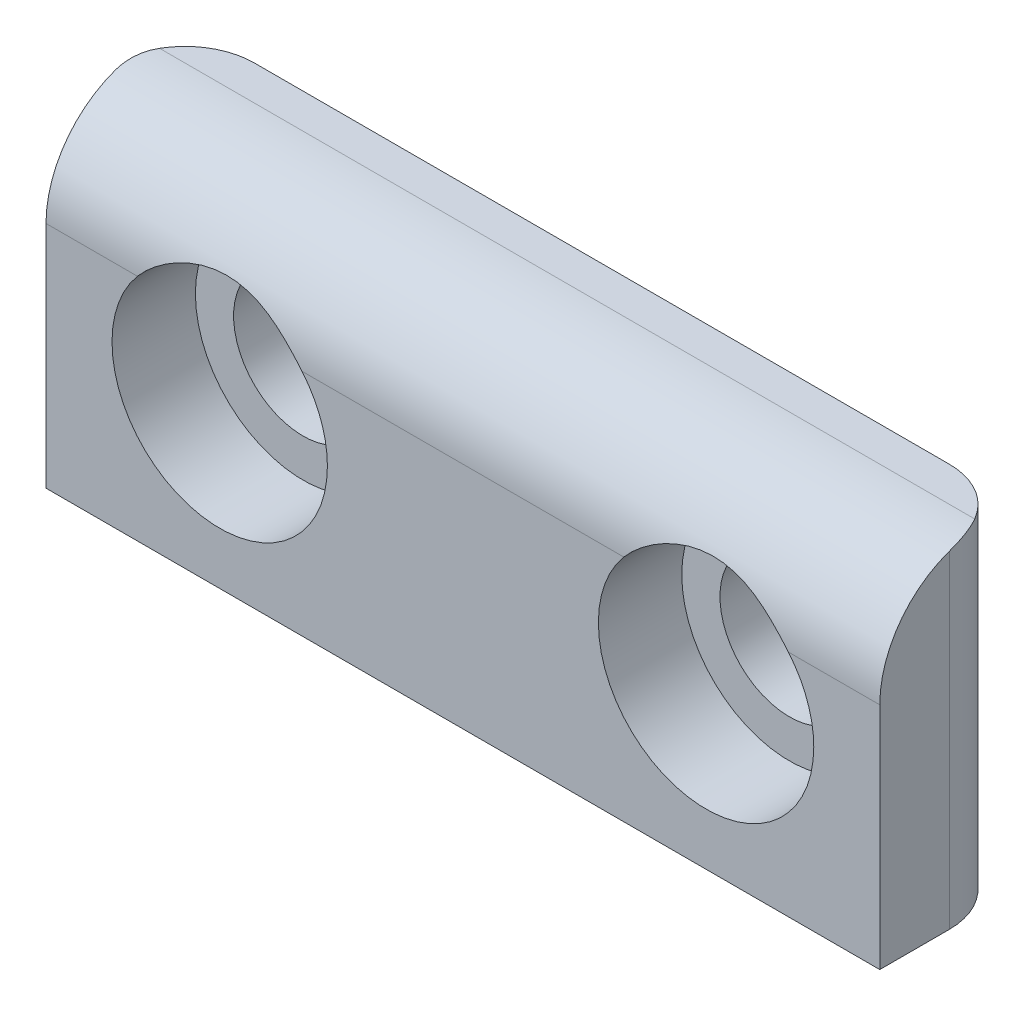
ISO-10303-21;
HEADER;
FILE_DESCRIPTION(('STEP AP214'),'2;1');
FILE_NAME('part.step','',(''),(''),'','','');
FILE_SCHEMA(('AUTOMOTIVE_DESIGN { 1 0 10303 214 1 1 1 1 }'));
ENDSEC;
DATA;
#1=APPLICATION_CONTEXT('core data for automotive mechanical design processes');
#2=APPLICATION_PROTOCOL_DEFINITION('international standard','automotive_design',2000,#1);
#3=PRODUCT_CONTEXT('',#1,'mechanical');
#4=PRODUCT('Part','Part','',(#3));
#5=PRODUCT_RELATED_PRODUCT_CATEGORY('part','',(#4));
#6=PRODUCT_DEFINITION_FORMATION('','',#4);
#7=PRODUCT_DEFINITION_CONTEXT('part definition',#1,'design');
#8=PRODUCT_DEFINITION('design','',#6,#7);
#9=PRODUCT_DEFINITION_SHAPE('','',#8);
#10=(LENGTH_UNIT() NAMED_UNIT(*) SI_UNIT(.MILLI.,.METRE.));
#11=(NAMED_UNIT(*) PLANE_ANGLE_UNIT() SI_UNIT($,.RADIAN.));
#12=(NAMED_UNIT(*) SI_UNIT($,.STERADIAN.) SOLID_ANGLE_UNIT());
#13=UNCERTAINTY_MEASURE_WITH_UNIT(LENGTH_MEASURE(1.E-05),#10,'distance_accuracy_value','');
#14=(GEOMETRIC_REPRESENTATION_CONTEXT(3) GLOBAL_UNCERTAINTY_ASSIGNED_CONTEXT((#13)) GLOBAL_UNIT_ASSIGNED_CONTEXT((#10,
#11,#12)) REPRESENTATION_CONTEXT('',''));
#15=CARTESIAN_POINT('',(0.,0.,0.));
#16=DIRECTION('',(0.,0.,1.));
#17=DIRECTION('',(1.,0.,0.));
#18=AXIS2_PLACEMENT_3D('',#15,#16,#17);
#19=CARTESIAN_POINT('',(-3.5,0.,0.8));
#20=DIRECTION('',(0.,0.,1.));
#21=DIRECTION('',(1.,0.,0.));
#22=AXIS2_PLACEMENT_3D('',#19,#20,#21);
#23=CYLINDRICAL_SURFACE('',#22,1.55);
#24=CARTESIAN_POINT('',(-3.5,0.,0.8));
#25=DIRECTION('',(0.,0.,1.));
#26=DIRECTION('',(1.,0.,0.));
#27=AXIS2_PLACEMENT_3D('',#24,#25,#26);
#28=CIRCLE('',#27,1.55);
#29=CARTESIAN_POINT('',(-1.95,0.,0.8));
#30=VERTEX_POINT('',#29);
#31=EDGE_CURVE('E142',#30,#30,#28,.T.);
#32=ORIENTED_EDGE('',*,*,#31,.F.);
#33=EDGE_LOOP('',(#32));
#34=FACE_BOUND('',#33,.T.);
#35=CARTESIAN_POINT('',(-3.5,0.,2.));
#36=DIRECTION('',(0.,0.,1.));
#37=DIRECTION('',(1.,0.,0.));
#38=AXIS2_PLACEMENT_3D('',#35,#36,#37);
#39=CIRCLE('',#38,1.55);
#40=CARTESIAN_POINT('',(-2.3157280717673,0.999999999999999,2.));
#41=VERTEX_POINT('',#40);
#42=CARTESIAN_POINT('',(-4.6842719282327,1.,2.));
#43=VERTEX_POINT('',#42);
#44=EDGE_CURVE('E110',#41,#43,#39,.F.);
#45=ORIENTED_EDGE('',*,*,#44,.F.);
#46=CARTESIAN_POINT('',(-4.6842719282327,0.999999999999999,2.));
#47=CARTESIAN_POINT('',(-4.65675995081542,1.03258544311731,1.99999961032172));
#48=CARTESIAN_POINT('',(-4.62792482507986,1.06400136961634,1.99893850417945));
#49=CARTESIAN_POINT('',(-4.56784959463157,1.12427985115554,1.995147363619));
#50=CARTESIAN_POINT('',(-4.53661174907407,1.15314475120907,1.99241888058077));
#51=CARTESIAN_POINT('',(-4.43971721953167,1.23555864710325,1.98242097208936));
#52=CARTESIAN_POINT('',(-4.37075665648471,1.28507172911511,1.97333510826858));
#53=CARTESIAN_POINT('',(-4.22608594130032,1.37201195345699,1.95382068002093));
#54=CARTESIAN_POINT('',(-4.15039293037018,1.40946872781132,1.94339549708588));
#55=CARTESIAN_POINT('',(-3.993716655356,1.47167917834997,1.92428272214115));
#56=CARTESIAN_POINT('',(-3.91273358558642,1.49643332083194,1.91559506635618));
#57=CARTESIAN_POINT('',(-3.74474897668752,1.53304251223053,1.90223755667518));
#58=CARTESIAN_POINT('',(-3.65763731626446,1.54445104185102,1.89770782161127));
#59=CARTESIAN_POINT('',(-3.48266267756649,1.55237247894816,1.89459913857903));
#60=CARTESIAN_POINT('',(-3.39480012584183,1.54889334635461,1.8960170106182));
#61=CARTESIAN_POINT('',(-3.22700275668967,1.52795557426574,1.90405418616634));
#62=CARTESIAN_POINT('',(-3.1469293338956,1.51144210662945,1.91032126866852));
#63=CARTESIAN_POINT('',(-2.99055988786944,1.46615342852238,1.92592747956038));
#64=CARTESIAN_POINT('',(-2.91426875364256,1.43736278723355,1.9352704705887));
#65=CARTESIAN_POINT('',(-2.76376023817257,1.36663576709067,1.95498714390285));
#66=CARTESIAN_POINT('',(-2.68980642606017,1.3241478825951,1.96538858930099));
#67=CARTESIAN_POINT('',(-2.54975103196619,1.22748732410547,1.98345841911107));
#68=CARTESIAN_POINT('',(-2.48362876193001,1.17334655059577,1.99113411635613));
#69=CARTESIAN_POINT('',(-2.40365141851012,1.09599321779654,1.99703548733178));
#70=CARTESIAN_POINT('',(-2.38539495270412,1.07742079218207,1.99812181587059));
#71=CARTESIAN_POINT('',(-2.34983778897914,1.03937614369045,1.99960373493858));
#72=CARTESIAN_POINT('',(-2.332536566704,1.01990442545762,1.99999970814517));
#73=CARTESIAN_POINT('',(-2.3157280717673,1.,2.));
#74=B_SPLINE_CURVE_WITH_KNOTS('',3,(#46,#47,#48,#49,#50,#51,#52,#53,#54,#55,#56,#57,#58,#59,#60,
#61,#62,#63,#64,#65,#66,#67,#68,#69,#70,#71,#72,#73),.UNSPECIFIED.,.F.,.F.,(4,2,2,2,2,2,2,2,2,2,
2,2,2,4),(0.,0.127822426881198,0.255526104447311,0.510371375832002,0.764585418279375,
1.01879012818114,1.281276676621,1.54362289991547,1.788520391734,2.0337265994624,
2.29039305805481,2.5463656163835,2.62453028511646,2.70265161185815),.UNSPECIFIED.);
#75=EDGE_CURVE('E134',#43,#41,#74,.T.);
#76=ORIENTED_EDGE('',*,*,#75,.F.);
#77=EDGE_LOOP('',(#45,#76));
#78=FACE_BOUND('',#77,.T.);
#79=ADVANCED_FACE('F17',(#34,#78),#23,.F.);
#80=CARTESIAN_POINT('',(3.5,0.,0.8));
#81=DIRECTION('',(0.,0.,1.));
#82=DIRECTION('',(1.,0.,0.));
#83=AXIS2_PLACEMENT_3D('',#80,#81,#82);
#84=CYLINDRICAL_SURFACE('',#83,1.55);
#85=CARTESIAN_POINT('',(3.5,0.,0.8));
#86=DIRECTION('',(0.,0.,1.));
#87=DIRECTION('',(1.,0.,0.));
#88=AXIS2_PLACEMENT_3D('',#85,#86,#87);
#89=CIRCLE('',#88,1.55);
#90=CARTESIAN_POINT('',(5.05,0.,0.8));
#91=VERTEX_POINT('',#90);
#92=EDGE_CURVE('E330',#91,#91,#89,.T.);
#93=ORIENTED_EDGE('',*,*,#92,.F.);
#94=EDGE_LOOP('',(#93));
#95=FACE_BOUND('',#94,.T.);
#96=CARTESIAN_POINT('',(3.5,0.,2.));
#97=DIRECTION('',(0.,0.,1.));
#98=DIRECTION('',(1.,0.,0.));
#99=AXIS2_PLACEMENT_3D('',#96,#97,#98);
#100=CIRCLE('',#99,1.55);
#101=CARTESIAN_POINT('',(4.6842719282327,1.,2.));
#102=VERTEX_POINT('',#101);
#103=CARTESIAN_POINT('',(2.3157280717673,1.,2.));
#104=VERTEX_POINT('',#103);
#105=EDGE_CURVE('E21',#102,#104,#100,.F.);
#106=ORIENTED_EDGE('',*,*,#105,.F.);
#107=CARTESIAN_POINT('',(2.3157280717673,1.,2.));
#108=CARTESIAN_POINT('',(2.34324004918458,1.03258544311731,1.99999961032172));
#109=CARTESIAN_POINT('',(2.37207517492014,1.06400136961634,1.99893850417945));
#110=CARTESIAN_POINT('',(2.43215040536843,1.12427985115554,1.995147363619));
#111=CARTESIAN_POINT('',(2.46338825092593,1.15314475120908,1.99241888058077));
#112=CARTESIAN_POINT('',(2.56028278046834,1.23555864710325,1.98242097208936));
#113=CARTESIAN_POINT('',(2.62924334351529,1.28507172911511,1.97333510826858));
#114=CARTESIAN_POINT('',(2.77391405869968,1.37201195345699,1.95382068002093));
#115=CARTESIAN_POINT('',(2.84960706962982,1.40946872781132,1.94339549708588));
#116=CARTESIAN_POINT('',(3.006283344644,1.47167917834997,1.92428272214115));
#117=CARTESIAN_POINT('',(3.08726641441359,1.49643332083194,1.91559506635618));
#118=CARTESIAN_POINT('',(3.25525102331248,1.53304251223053,1.90223755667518));
#119=CARTESIAN_POINT('',(3.34236268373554,1.54445104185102,1.89770782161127));
#120=CARTESIAN_POINT('',(3.51733732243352,1.55237247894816,1.89459913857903));
#121=CARTESIAN_POINT('',(3.60519987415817,1.54889334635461,1.8960170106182));
#122=CARTESIAN_POINT('',(3.77299724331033,1.52795557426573,1.90405418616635));
#123=CARTESIAN_POINT('',(3.8530706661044,1.51144210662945,1.91032126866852));
#124=CARTESIAN_POINT('',(4.00944011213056,1.46615342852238,1.92592747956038));
#125=CARTESIAN_POINT('',(4.08573124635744,1.43736278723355,1.9352704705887));
#126=CARTESIAN_POINT('',(4.23623976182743,1.36663576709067,1.95498714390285));
#127=CARTESIAN_POINT('',(4.31019357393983,1.3241478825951,1.96538858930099));
#128=CARTESIAN_POINT('',(4.45024896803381,1.22748732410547,1.98345841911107));
#129=CARTESIAN_POINT('',(4.51637123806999,1.17334655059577,1.99113411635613));
#130=CARTESIAN_POINT('',(4.59634858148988,1.09599321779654,1.99703548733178));
#131=CARTESIAN_POINT('',(4.61460504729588,1.07742079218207,1.99812181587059));
#132=CARTESIAN_POINT('',(4.65016221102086,1.03937614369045,1.99960373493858));
#133=CARTESIAN_POINT('',(4.667463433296,1.01990442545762,1.99999970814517));
#134=CARTESIAN_POINT('',(4.6842719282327,1.,2.));
#135=B_SPLINE_CURVE_WITH_KNOTS('',3,(#107,#108,#109,#110,#111,#112,#113,#114,#115,#116,#117,
#118,#119,#120,#121,#122,#123,#124,#125,#126,#127,#128,#129,#130,#131,#132,#133,#134),
.UNSPECIFIED.,.F.,.F.,(4,2,2,2,2,2,2,2,2,2,2,2,2,4),(0.,0.127822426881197,0.255526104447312,
0.510371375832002,0.764585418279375,1.01879012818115,1.281276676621,1.54362289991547,
1.788520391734,2.0337265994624,2.29039305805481,2.5463656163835,2.62453028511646,
2.70265161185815),.UNSPECIFIED.);
#136=EDGE_CURVE('E105',#104,#102,#135,.T.);
#137=ORIENTED_EDGE('',*,*,#136,.F.);
#138=EDGE_LOOP('',(#106,#137));
#139=FACE_BOUND('',#138,.T.);
#140=ADVANCED_FACE('F104',(#95,#139),#84,.F.);
#141=CARTESIAN_POINT('',(-5.8,-2.5,4.));
#142=DIRECTION('',(0.707106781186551,0.707106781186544,0.));
#143=DIRECTION('',(-0.707106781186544,0.707106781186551,0.));
#144=AXIS2_PLACEMENT_3D('',#141,#142,#143);
#145=PLANE('',#144);
#146=DIRECTION('',(0.,0.,1.));
#147=VECTOR('',#146,1.);
#148=CARTESIAN_POINT('',(-5.8,-2.5,4.));
#149=LINE('',#148,#147);
#150=CARTESIAN_POINT('',(-5.79999999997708,-2.50000000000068,1.));
#151=VERTEX_POINT('',#150);
#152=CARTESIAN_POINT('',(-5.8,-2.5,1.8));
#153=VERTEX_POINT('',#152);
#154=EDGE_CURVE('E149',#151,#153,#149,.T.);
#155=ORIENTED_EDGE('',*,*,#154,.T.);
#156=DIRECTION('',(0.577350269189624,-0.577350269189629,-0.577350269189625));
#157=VECTOR('',#156,1.);
#158=CARTESIAN_POINT('',(-6.,-2.3,2.));
#159=LINE('',#158,#157);
#160=CARTESIAN_POINT('',(-6.,-2.3,2.));
#161=VERTEX_POINT('',#160);
#162=EDGE_CURVE('E136',#161,#153,#159,.T.);
#163=ORIENTED_EDGE('',*,*,#162,.F.);
#164=DIRECTION('',(0.,0.,-1.));
#165=VECTOR('',#164,1.);
#166=CARTESIAN_POINT('',(-6.,-2.3,4.));
#167=LINE('',#166,#165);
#168=CARTESIAN_POINT('',(-5.99999999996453,-2.30000000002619,1.));
#169=VERTEX_POINT('',#168);
#170=EDGE_CURVE('E185',#161,#169,#167,.T.);
#171=ORIENTED_EDGE('',*,*,#170,.T.);
#172=DIRECTION('',(0.707106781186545,-0.707106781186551,0.));
#173=VECTOR('',#172,1.);
#174=CARTESIAN_POINT('',(-499004.,498995.700000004,0.999999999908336));
#175=LINE('',#174,#173);
#176=EDGE_CURVE('E189',#151,#169,#175,.F.);
#177=ORIENTED_EDGE('',*,*,#176,.F.);
#178=EDGE_LOOP('',(#155,#163,#171,#177));
#179=FACE_BOUND('',#178,.T.);
#180=ADVANCED_FACE('F351',(#179),#145,.F.);
#181=CARTESIAN_POINT('',(-1.5,-2.3,2.));
#182=DIRECTION('',(0.,-0.707106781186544,0.707106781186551));
#183=DIRECTION('',(0.,-0.707106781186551,-0.707106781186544));
#184=AXIS2_PLACEMENT_3D('',#181,#182,#183);
#185=PLANE('',#184);
#186=DIRECTION('',(0.577350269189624,0.577350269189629,0.577350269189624));
#187=VECTOR('',#186,1.);
#188=CARTESIAN_POINT('',(5.8,-2.5,1.8));
#189=LINE('',#188,#187);
#190=CARTESIAN_POINT('',(5.8,-2.5,1.8));
#191=VERTEX_POINT('',#190);
#192=CARTESIAN_POINT('',(6.,-2.3,2.));
#193=VERTEX_POINT('',#192);
#194=EDGE_CURVE('E139',#191,#193,#189,.T.);
#195=ORIENTED_EDGE('',*,*,#194,.T.);
#196=DIRECTION('',(1.,0.,0.));
#197=VECTOR('',#196,1.);
#198=CARTESIAN_POINT('',(-1.5,-2.3,2.));
#199=LINE('',#198,#197);
#200=EDGE_CURVE('E111',#161,#193,#199,.T.);
#201=ORIENTED_EDGE('',*,*,#200,.F.);
#202=ORIENTED_EDGE('',*,*,#162,.T.);
#203=DIRECTION('',(-1.,0.,0.));
#204=VECTOR('',#203,1.);
#205=CARTESIAN_POINT('',(6.,-2.5,1.8));
#206=LINE('',#205,#204);
#207=EDGE_CURVE('E145',#153,#191,#206,.F.);
#208=ORIENTED_EDGE('',*,*,#207,.T.);
#209=EDGE_LOOP('',(#195,#201,#202,#208));
#210=FACE_BOUND('',#209,.T.);
#211=ADVANCED_FACE('F356',(#210),#185,.T.);
#212=CARTESIAN_POINT('',(-1.5,2.5,2.));
#213=DIRECTION('',(0.,0.,1.));
#214=DIRECTION('',(1.,0.,0.));
#215=AXIS2_PLACEMENT_3D('',#212,#213,#214);
#216=PLANE('',#215);
#217=DIRECTION('',(1.,0.,0.));
#218=VECTOR('',#217,1.);
#219=CARTESIAN_POINT('',(-1.5,0.999999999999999,2.));
#220=LINE('',#219,#218);
#221=EDGE_CURVE('E119',#41,#104,#220,.T.);
#222=ORIENTED_EDGE('',*,*,#221,.F.);
#223=ORIENTED_EDGE('',*,*,#44,.T.);
#224=DIRECTION('',(1.,0.,0.));
#225=VECTOR('',#224,1.);
#226=CARTESIAN_POINT('',(-1.5,1.,2.));
#227=LINE('',#226,#225);
#228=CARTESIAN_POINT('',(-6.,1.,2.));
#229=VERTEX_POINT('',#228);
#230=EDGE_CURVE('E131',#229,#43,#227,.T.);
#231=ORIENTED_EDGE('',*,*,#230,.F.);
#232=DIRECTION('',(0.,1.,0.));
#233=VECTOR('',#232,1.);
#234=CARTESIAN_POINT('',(-6.,-2.5,2.));
#235=LINE('',#234,#233);
#236=EDGE_CURVE('E188',#229,#161,#235,.F.);
#237=ORIENTED_EDGE('',*,*,#236,.T.);
#238=ORIENTED_EDGE('',*,*,#200,.T.);
#239=DIRECTION('',(0.,1.,0.));
#240=VECTOR('',#239,1.);
#241=CARTESIAN_POINT('',(6.,-2.5,2.));
#242=LINE('',#241,#240);
#243=CARTESIAN_POINT('',(6.,1.,2.));
#244=VERTEX_POINT('',#243);
#245=EDGE_CURVE('E124',#193,#244,#242,.T.);
#246=ORIENTED_EDGE('',*,*,#245,.T.);
#247=DIRECTION('',(1.,0.,0.));
#248=VECTOR('',#247,1.);
#249=CARTESIAN_POINT('',(-1.5,0.999999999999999,2.));
#250=LINE('',#249,#248);
#251=EDGE_CURVE('E116',#102,#244,#250,.T.);
#252=ORIENTED_EDGE('',*,*,#251,.F.);
#253=ORIENTED_EDGE('',*,*,#105,.T.);
#254=EDGE_LOOP('',(#222,#223,#231,#237,#238,#246,#252,#253));
#255=FACE_BOUND('',#254,.T.);
#256=ADVANCED_FACE('F122',(#255),#216,.T.);
#257=CARTESIAN_POINT('',(6.,-2.3,4.));
#258=DIRECTION('',(-0.707106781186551,0.707106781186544,0.));
#259=DIRECTION('',(-0.707106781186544,-0.707106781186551,0.));
#260=AXIS2_PLACEMENT_3D('',#257,#258,#259);
#261=PLANE('',#260);
#262=DIRECTION('',(0.,0.,1.));
#263=VECTOR('',#262,1.);
#264=CARTESIAN_POINT('',(6.,-2.3,4.));
#265=LINE('',#264,#263);
#266=CARTESIAN_POINT('',(5.99999999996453,-2.30000000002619,1.));
#267=VERTEX_POINT('',#266);
#268=EDGE_CURVE('E181',#267,#193,#265,.T.);
#269=ORIENTED_EDGE('',*,*,#268,.T.);
#270=ORIENTED_EDGE('',*,*,#194,.F.);
#271=DIRECTION('',(0.,0.,1.));
#272=VECTOR('',#271,1.);
#273=CARTESIAN_POINT('',(5.8,-2.5,4.));
#274=LINE('',#273,#272);
#275=CARTESIAN_POINT('',(5.79999999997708,-2.49999999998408,1.));
#276=VERTEX_POINT('',#275);
#277=EDGE_CURVE('E148',#191,#276,#274,.F.);
#278=ORIENTED_EDGE('',*,*,#277,.T.);
#279=DIRECTION('',(-0.707106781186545,-0.707106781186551,0.));
#280=VECTOR('',#279,1.);
#281=CARTESIAN_POINT('',(499004.,498995.700000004,1.00000000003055));
#282=LINE('',#281,#280);
#283=EDGE_CURVE('E178',#267,#276,#282,.T.);
#284=ORIENTED_EDGE('',*,*,#283,.F.);
#285=EDGE_LOOP('',(#269,#270,#278,#284));
#286=FACE_BOUND('',#285,.T.);
#287=ADVANCED_FACE('F367',(#286),#261,.F.);
#288=CARTESIAN_POINT('',(-3.5,0.,0.8));
#289=DIRECTION('',(0.,0.,1.));
#290=DIRECTION('',(1.,0.,0.));
#291=AXIS2_PLACEMENT_3D('',#288,#289,#290);
#292=PLANE('',#291);
#293=ORIENTED_EDGE('',*,*,#31,.T.);
#294=EDGE_LOOP('',(#293));
#295=FACE_BOUND('',#294,.T.);
#296=CARTESIAN_POINT('',(-3.5,0.,0.8));
#297=DIRECTION('',(0.,0.,1.));
#298=DIRECTION('',(1.,0.,0.));
#299=AXIS2_PLACEMENT_3D('',#296,#297,#298);
#300=CIRCLE('',#299,1.);
#301=CARTESIAN_POINT('',(-2.5,0.,0.8));
#302=VERTEX_POINT('',#301);
#303=EDGE_CURVE('E173',#302,#302,#300,.F.);
#304=ORIENTED_EDGE('',*,*,#303,.T.);
#305=EDGE_LOOP('',(#304));
#306=FACE_BOUND('',#305,.T.);
#307=ADVANCED_FACE('F344',(#295,#306),#292,.T.);
#308=CARTESIAN_POINT('',(3.5,0.,0.8));
#309=DIRECTION('',(0.,0.,1.));
#310=DIRECTION('',(1.,0.,0.));
#311=AXIS2_PLACEMENT_3D('',#308,#309,#310);
#312=PLANE('',#311);
#313=ORIENTED_EDGE('',*,*,#92,.T.);
#314=EDGE_LOOP('',(#313));
#315=FACE_BOUND('',#314,.T.);
#316=CARTESIAN_POINT('',(3.5,0.,0.8));
#317=DIRECTION('',(0.,0.,1.));
#318=DIRECTION('',(1.,0.,0.));
#319=AXIS2_PLACEMENT_3D('',#316,#317,#318);
#320=CIRCLE('',#319,1.);
#321=CARTESIAN_POINT('',(4.5,0.,0.8));
#322=VERTEX_POINT('',#321);
#323=EDGE_CURVE('E169',#322,#322,#320,.F.);
#324=ORIENTED_EDGE('',*,*,#323,.T.);
#325=EDGE_LOOP('',(#324));
#326=FACE_BOUND('',#325,.T.);
#327=ADVANCED_FACE('F243',(#315,#326),#312,.T.);
#328=CARTESIAN_POINT('',(-1.5,0.999999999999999,0.5));
#329=DIRECTION('',(1.,0.,0.));
#330=DIRECTION('',(0.,1.,0.));
#331=AXIS2_PLACEMENT_3D('',#328,#329,#330);
#332=CYLINDRICAL_SURFACE('',#331,1.5);
#333=CARTESIAN_POINT('',(-6.,0.999999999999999,0.5));
#334=DIRECTION('',(1.,0.,0.));
#335=DIRECTION('',(0.,1.,0.));
#336=AXIS2_PLACEMENT_3D('',#333,#334,#335);
#337=CIRCLE('',#336,1.5);
#338=CARTESIAN_POINT('',(-6.,2.41421356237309,1.));
#339=VERTEX_POINT('',#338);
#340=EDGE_CURVE('E186',#339,#229,#337,.T.);
#341=ORIENTED_EDGE('',*,*,#340,.T.);
#342=ORIENTED_EDGE('',*,*,#230,.T.);
#343=ORIENTED_EDGE('',*,*,#75,.T.);
#344=ORIENTED_EDGE('',*,*,#221,.T.);
#345=ORIENTED_EDGE('',*,*,#136,.T.);
#346=ORIENTED_EDGE('',*,*,#251,.T.);
#347=CARTESIAN_POINT('',(6.,1.,0.5));
#348=DIRECTION('',(1.,0.,0.));
#349=DIRECTION('',(0.,1.,0.));
#350=AXIS2_PLACEMENT_3D('',#347,#348,#349);
#351=CIRCLE('',#350,1.5);
#352=CARTESIAN_POINT('',(6.,2.4142135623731,1.));
#353=VERTEX_POINT('',#352);
#354=EDGE_CURVE('E179',#244,#353,#351,.F.);
#355=ORIENTED_EDGE('',*,*,#354,.T.);
#356=CARTESIAN_POINT('',(6.,2.4142135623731,1.));
#357=CARTESIAN_POINT('',(6.00000096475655,2.42242987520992,0.97676742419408));
#358=CARTESIAN_POINT('',(5.99918941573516,2.43006580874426,0.953339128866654));
#359=CARTESIAN_POINT('',(5.99587497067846,2.44415133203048,0.906239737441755));
#360=CARTESIAN_POINT('',(5.99337156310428,2.45060056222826,0.882568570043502));
#361=CARTESIAN_POINT('',(5.98340586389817,2.46781004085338,0.812705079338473));
#362=CARTESIAN_POINT('',(5.97349270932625,2.47687349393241,0.76640132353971));
#363=CARTESIAN_POINT('',(5.94922229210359,2.48929563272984,0.682933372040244));
#364=CARTESIAN_POINT('',(5.93591387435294,2.4933644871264,0.645559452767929));
#365=CARTESIAN_POINT('',(5.90454328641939,2.49876013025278,0.57167700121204));
#366=CARTESIAN_POINT('',(5.88638338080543,2.50002490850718,0.535205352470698));
#367=CARTESIAN_POINT('',(5.86602540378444,2.5,0.5));
#368=B_SPLINE_CURVE_WITH_KNOTS('',3,(#356,#357,#358,#359,#360,#361,#362,#363,#364,#365,#366,
#367),.UNSPECIFIED.,.F.,.F.,(4,2,2,2,2,4),(0.,0.0738867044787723,0.1477957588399,
0.291655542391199,0.410933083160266,0.532823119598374),.UNSPECIFIED.);
#369=CARTESIAN_POINT('',(5.86602540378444,2.5,0.5));
#370=VERTEX_POINT('',#369);
#371=EDGE_CURVE('E125',#353,#370,#368,.T.);
#372=ORIENTED_EDGE('',*,*,#371,.T.);
#373=DIRECTION('',(1.,0.,0.));
#374=VECTOR('',#373,1.);
#375=CARTESIAN_POINT('',(6.,2.5,0.5));
#376=LINE('',#375,#374);
#377=CARTESIAN_POINT('',(-5.86602540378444,2.5,0.5));
#378=VERTEX_POINT('',#377);
#379=EDGE_CURVE('E172',#370,#378,#376,.F.);
#380=ORIENTED_EDGE('',*,*,#379,.T.);
#381=CARTESIAN_POINT('',(-5.86602540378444,2.5,0.5));
#382=CARTESIAN_POINT('',(-5.87834794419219,2.50000117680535,0.521341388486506));
#383=CARTESIAN_POINT('',(-5.88987433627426,2.49954388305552,0.54313122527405));
#384=CARTESIAN_POINT('',(-5.9112772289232,2.49761195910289,0.587470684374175));
#385=CARTESIAN_POINT('',(-5.92115322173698,2.49613701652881,0.610020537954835));
#386=CARTESIAN_POINT('',(-5.94772522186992,2.49014439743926,0.677359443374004));
#387=CARTESIAN_POINT('',(-5.96202989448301,2.48406814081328,0.722998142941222));
#388=CARTESIAN_POINT('',(-5.98200527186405,2.46873424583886,0.807117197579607));
#389=CARTESIAN_POINT('',(-5.98873367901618,2.46019770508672,0.845488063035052));
#390=CARTESIAN_POINT('',(-5.99779494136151,2.43976515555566,0.922767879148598));
#391=CARTESIAN_POINT('',(-6.00002831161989,2.42779967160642,0.961670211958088));
#392=CARTESIAN_POINT('',(-6.,2.41421356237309,0.999999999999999));
#393=B_SPLINE_CURVE_WITH_KNOTS('',3,(#381,#382,#383,#384,#385,#386,#387,#388,#389,#390,#391,
#392),.UNSPECIFIED.,.F.,.F.,(4,2,2,2,2,4),(0.,0.0738878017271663,0.147798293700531,
0.291658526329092,0.410934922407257,0.532823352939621),.UNSPECIFIED.);
#394=EDGE_CURVE('E127',#378,#339,#393,.T.);
#395=ORIENTED_EDGE('',*,*,#394,.T.);
#396=EDGE_LOOP('',(#341,#342,#343,#344,#345,#346,#355,#372,#380,#395));
#397=FACE_BOUND('',#396,.T.);
#398=ADVANCED_FACE('F114',(#397),#332,.T.);
#399=CARTESIAN_POINT('',(-5.,-2.30000000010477,1.));
#400=DIRECTION('',(0.,1.,0.));
#401=DIRECTION('',(0.,0.,1.));
#402=AXIS2_PLACEMENT_3D('',#399,#400,#401);
#403=CONICAL_SURFACE('',#402,0.999999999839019,0.785398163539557);
#404=ORIENTED_EDGE('',*,*,#176,.T.);
#405=CARTESIAN_POINT('',(-5.,-2.3,1.));
#406=DIRECTION('',(0.,-1.,0.));
#407=DIRECTION('',(0.,0.,-1.));
#408=AXIS2_PLACEMENT_3D('',#405,#406,#407);
#409=CIRCLE('',#408,1.);
#410=CARTESIAN_POINT('',(-5.,-2.30000000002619,4.2632564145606E-11));
#411=VERTEX_POINT('',#410);
#412=EDGE_CURVE('E272',#411,#169,#409,.F.);
#413=ORIENTED_EDGE('',*,*,#412,.F.);
#414=DIRECTION('',(0.,-0.707106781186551,0.707106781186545));
#415=VECTOR('',#414,1.);
#416=CARTESIAN_POINT('',(-4.99999999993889,498995.700000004,-498998.));
#417=LINE('',#416,#415);
#418=CARTESIAN_POINT('',(-5.,-2.49999999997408,0.200000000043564));
#419=VERTEX_POINT('',#418);
#420=EDGE_CURVE('E317',#411,#419,#417,.T.);
#421=ORIENTED_EDGE('',*,*,#420,.T.);
#422=CARTESIAN_POINT('',(-5.,-2.49999999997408,1.));
#423=DIRECTION('',(0.,1.,0.));
#424=DIRECTION('',(0.,0.,1.));
#425=AXIS2_PLACEMENT_3D('',#422,#423,#424);
#426=CIRCLE('',#425,0.79999999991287);
#427=EDGE_CURVE('E182',#419,#151,#426,.T.);
#428=ORIENTED_EDGE('',*,*,#427,.T.);
#429=EDGE_LOOP('',(#404,#413,#421,#428));
#430=FACE_BOUND('',#429,.T.);
#431=ADVANCED_FACE('F235',(#430),#403,.T.);
#432=CARTESIAN_POINT('',(-6.,-2.5,4.));
#433=DIRECTION('',(1.,0.,0.));
#434=DIRECTION('',(0.,0.,-1.));
#435=AXIS2_PLACEMENT_3D('',#432,#433,#434);
#436=PLANE('',#435);
#437=ORIENTED_EDGE('',*,*,#170,.F.);
#438=ORIENTED_EDGE('',*,*,#236,.F.);
#439=ORIENTED_EDGE('',*,*,#340,.F.);
#440=DIRECTION('',(0.,-1.,0.));
#441=VECTOR('',#440,1.);
#442=CARTESIAN_POINT('',(-6.,-2.5,1.));
#443=LINE('',#442,#441);
#444=EDGE_CURVE('E168',#169,#339,#443,.F.);
#445=ORIENTED_EDGE('',*,*,#444,.F.);
#446=EDGE_LOOP('',(#437,#438,#439,#445));
#447=FACE_BOUND('',#446,.T.);
#448=ADVANCED_FACE('F232',(#447),#436,.F.);
#449=CARTESIAN_POINT('',(6.,-2.5,4.));
#450=DIRECTION('',(0.,1.,0.));
#451=DIRECTION('',(-1.,0.,0.));
#452=AXIS2_PLACEMENT_3D('',#449,#450,#451);
#453=PLANE('',#452);
#454=ORIENTED_EDGE('',*,*,#207,.F.);
#455=ORIENTED_EDGE('',*,*,#154,.F.);
#456=ORIENTED_EDGE('',*,*,#427,.F.);
#457=DIRECTION('',(1.,0.,0.));
#458=VECTOR('',#457,1.);
#459=CARTESIAN_POINT('',(6.,-2.5,0.2));
#460=LINE('',#459,#458);
#461=CARTESIAN_POINT('',(5.,-2.49999999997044,0.199999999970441));
#462=VERTEX_POINT('',#461);
#463=EDGE_CURVE('E167',#419,#462,#460,.T.);
#464=ORIENTED_EDGE('',*,*,#463,.T.);
#465=CARTESIAN_POINT('',(5.,-2.49999999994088,1.));
#466=DIRECTION('',(0.,1.,0.));
#467=DIRECTION('',(0.,0.,1.));
#468=AXIS2_PLACEMENT_3D('',#465,#466,#467);
#469=CIRCLE('',#468,0.799999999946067);
#470=EDGE_CURVE('E176',#276,#462,#469,.T.);
#471=ORIENTED_EDGE('',*,*,#470,.F.);
#472=ORIENTED_EDGE('',*,*,#277,.F.);
#473=EDGE_LOOP('',(#454,#455,#456,#464,#471,#472));
#474=FACE_BOUND('',#473,.T.);
#475=ADVANCED_FACE('F228',(#474),#453,.F.);
#476=CARTESIAN_POINT('',(6.,-2.5,4.));
#477=DIRECTION('',(-1.,0.,0.));
#478=DIRECTION('',(0.,0.,1.));
#479=AXIS2_PLACEMENT_3D('',#476,#477,#478);
#480=PLANE('',#479);
#481=ORIENTED_EDGE('',*,*,#268,.F.);
#482=DIRECTION('',(0.,1.,0.));
#483=VECTOR('',#482,1.);
#484=CARTESIAN_POINT('',(6.,-2.5,1.));
#485=LINE('',#484,#483);
#486=EDGE_CURVE('E291',#353,#267,#485,.F.);
#487=ORIENTED_EDGE('',*,*,#486,.F.);
#488=ORIENTED_EDGE('',*,*,#354,.F.);
#489=ORIENTED_EDGE('',*,*,#245,.F.);
#490=EDGE_LOOP('',(#481,#487,#488,#489));
#491=FACE_BOUND('',#490,.T.);
#492=ADVANCED_FACE('F224',(#491),#480,.F.);
#493=CARTESIAN_POINT('',(5.,-2.30000000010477,1.));
#494=DIRECTION('',(0.,1.,0.));
#495=DIRECTION('',(0.,0.,1.));
#496=AXIS2_PLACEMENT_3D('',#493,#494,#495);
#497=CONICAL_SURFACE('',#496,0.999999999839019,0.785398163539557);
#498=ORIENTED_EDGE('',*,*,#283,.T.);
#499=ORIENTED_EDGE('',*,*,#470,.T.);
#500=DIRECTION('',(0.,-0.707106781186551,0.707106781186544));
#501=VECTOR('',#500,1.);
#502=CARTESIAN_POINT('',(5.,-2.5,0.199999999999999));
#503=LINE('',#502,#501);
#504=CARTESIAN_POINT('',(5.,-2.29999999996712,1.18235171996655E-11));
#505=VERTEX_POINT('',#504);
#506=EDGE_CURVE('E304',#462,#505,#503,.F.);
#507=ORIENTED_EDGE('',*,*,#506,.T.);
#508=CARTESIAN_POINT('',(5.,-2.3,1.));
#509=DIRECTION('',(0.,1.,0.));
#510=DIRECTION('',(0.,0.,1.));
#511=AXIS2_PLACEMENT_3D('',#508,#509,#510);
#512=CIRCLE('',#511,1.);
#513=EDGE_CURVE('E35',#267,#505,#512,.T.);
#514=ORIENTED_EDGE('',*,*,#513,.F.);
#515=EDGE_LOOP('',(#498,#499,#507,#514));
#516=FACE_BOUND('',#515,.T.);
#517=ADVANCED_FACE('F220',(#516),#497,.T.);
#518=CARTESIAN_POINT('',(-3.5,0.,-2.82842712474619));
#519=DIRECTION('',(0.,0.,1.));
#520=DIRECTION('',(1.,0.,0.));
#521=AXIS2_PLACEMENT_3D('',#518,#519,#520);
#522=CYLINDRICAL_SURFACE('',#521,1.);
#523=ORIENTED_EDGE('',*,*,#303,.F.);
#524=EDGE_LOOP('',(#523));
#525=FACE_BOUND('',#524,.T.);
#526=CARTESIAN_POINT('',(-3.5,0.,0.));
#527=DIRECTION('',(0.,0.,1.));
#528=DIRECTION('',(1.,0.,0.));
#529=AXIS2_PLACEMENT_3D('',#526,#527,#528);
#530=CIRCLE('',#529,1.);
#531=CARTESIAN_POINT('',(-2.5,0.,0.));
#532=VERTEX_POINT('',#531);
#533=EDGE_CURVE('E159',#532,#532,#530,.F.);
#534=ORIENTED_EDGE('',*,*,#533,.T.);
#535=EDGE_LOOP('',(#534));
#536=FACE_BOUND('',#535,.T.);
#537=ADVANCED_FACE('F216',(#525,#536),#522,.F.);
#538=CARTESIAN_POINT('',(3.5,0.,-2.82842712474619));
#539=DIRECTION('',(0.,0.,1.));
#540=DIRECTION('',(1.,0.,0.));
#541=AXIS2_PLACEMENT_3D('',#538,#539,#540);
#542=CYLINDRICAL_SURFACE('',#541,1.);
#543=ORIENTED_EDGE('',*,*,#323,.F.);
#544=EDGE_LOOP('',(#543));
#545=FACE_BOUND('',#544,.T.);
#546=CARTESIAN_POINT('',(3.5,0.,0.));
#547=DIRECTION('',(0.,0.,1.));
#548=DIRECTION('',(1.,0.,0.));
#549=AXIS2_PLACEMENT_3D('',#546,#547,#548);
#550=CIRCLE('',#549,1.);
#551=CARTESIAN_POINT('',(4.5,0.,0.));
#552=VERTEX_POINT('',#551);
#553=EDGE_CURVE('E155',#552,#552,#550,.F.);
#554=ORIENTED_EDGE('',*,*,#553,.T.);
#555=EDGE_LOOP('',(#554));
#556=FACE_BOUND('',#555,.T.);
#557=ADVANCED_FACE('F212',(#545,#556),#542,.F.);
#558=CARTESIAN_POINT('',(6.,2.5,4.));
#559=DIRECTION('',(0.,-1.,0.));
#560=DIRECTION('',(1.,0.,0.));
#561=AXIS2_PLACEMENT_3D('',#558,#559,#560);
#562=PLANE('',#561);
#563=CARTESIAN_POINT('',(-5.,2.5,1.));
#564=DIRECTION('',(0.,-1.,0.));
#565=DIRECTION('',(0.,0.,-1.));
#566=AXIS2_PLACEMENT_3D('',#563,#564,#565);
#567=CIRCLE('',#566,1.);
#568=CARTESIAN_POINT('',(-5.,2.5,0.));
#569=VERTEX_POINT('',#568);
#570=EDGE_CURVE('E165',#378,#569,#567,.T.);
#571=ORIENTED_EDGE('',*,*,#570,.F.);
#572=ORIENTED_EDGE('',*,*,#379,.F.);
#573=CARTESIAN_POINT('',(5.,2.5,1.));
#574=DIRECTION('',(0.,1.,0.));
#575=DIRECTION('',(0.,0.,1.));
#576=AXIS2_PLACEMENT_3D('',#573,#574,#575);
#577=CIRCLE('',#576,1.);
#578=CARTESIAN_POINT('',(5.,2.5,0.));
#579=VERTEX_POINT('',#578);
#580=EDGE_CURVE('E162',#579,#370,#577,.F.);
#581=ORIENTED_EDGE('',*,*,#580,.F.);
#582=DIRECTION('',(1.,0.,0.));
#583=VECTOR('',#582,1.);
#584=CARTESIAN_POINT('',(-6.,2.5,0.));
#585=LINE('',#584,#583);
#586=EDGE_CURVE('E158',#579,#569,#585,.F.);
#587=ORIENTED_EDGE('',*,*,#586,.T.);
#588=EDGE_LOOP('',(#571,#572,#581,#587));
#589=FACE_BOUND('',#588,.T.);
#590=ADVANCED_FACE('F208',(#589),#562,.F.);
#591=CARTESIAN_POINT('',(-5.,-2.5,1.));
#592=DIRECTION('',(0.,-1.,0.));
#593=DIRECTION('',(0.,0.,-1.));
#594=AXIS2_PLACEMENT_3D('',#591,#592,#593);
#595=CYLINDRICAL_SURFACE('',#594,1.);
#596=ORIENTED_EDGE('',*,*,#394,.F.);
#597=ORIENTED_EDGE('',*,*,#570,.T.);
#598=DIRECTION('',(0.,1.,0.));
#599=VECTOR('',#598,1.);
#600=CARTESIAN_POINT('',(-5.,2.5,0.));
#601=LINE('',#600,#599);
#602=EDGE_CURVE('E264',#569,#411,#601,.F.);
#603=ORIENTED_EDGE('',*,*,#602,.T.);
#604=ORIENTED_EDGE('',*,*,#412,.T.);
#605=ORIENTED_EDGE('',*,*,#444,.T.);
#606=EDGE_LOOP('',(#596,#597,#603,#604,#605));
#607=FACE_BOUND('',#606,.T.);
#608=ADVANCED_FACE('F202',(#607),#595,.T.);
#609=CARTESIAN_POINT('',(6.,-2.5,0.199999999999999));
#610=DIRECTION('',(0.,0.707106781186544,0.707106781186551));
#611=DIRECTION('',(0.,-0.707106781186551,0.707106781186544));
#612=AXIS2_PLACEMENT_3D('',#609,#610,#611);
#613=PLANE('',#612);
#614=ORIENTED_EDGE('',*,*,#463,.F.);
#615=ORIENTED_EDGE('',*,*,#420,.F.);
#616=DIRECTION('',(1.,0.,0.));
#617=VECTOR('',#616,1.);
#618=CARTESIAN_POINT('',(-6.,-2.3,0.));
#619=LINE('',#618,#617);
#620=EDGE_CURVE('E27',#411,#505,#619,.T.);
#621=ORIENTED_EDGE('',*,*,#620,.T.);
#622=ORIENTED_EDGE('',*,*,#506,.F.);
#623=EDGE_LOOP('',(#614,#615,#621,#622));
#624=FACE_BOUND('',#623,.T.);
#625=ADVANCED_FACE('F207',(#624),#613,.F.);
#626=CARTESIAN_POINT('',(5.,-2.5,1.));
#627=DIRECTION('',(0.,1.,0.));
#628=DIRECTION('',(0.,0.,1.));
#629=AXIS2_PLACEMENT_3D('',#626,#627,#628);
#630=CYLINDRICAL_SURFACE('',#629,1.);
#631=ORIENTED_EDGE('',*,*,#580,.T.);
#632=ORIENTED_EDGE('',*,*,#371,.F.);
#633=ORIENTED_EDGE('',*,*,#486,.T.);
#634=ORIENTED_EDGE('',*,*,#513,.T.);
#635=DIRECTION('',(0.,1.,0.));
#636=VECTOR('',#635,1.);
#637=CARTESIAN_POINT('',(5.,2.5,0.));
#638=LINE('',#637,#636);
#639=EDGE_CURVE('E11',#505,#579,#638,.T.);
#640=ORIENTED_EDGE('',*,*,#639,.T.);
#641=EDGE_LOOP('',(#631,#632,#633,#634,#640));
#642=FACE_BOUND('',#641,.T.);
#643=ADVANCED_FACE('F246',(#642),#630,.T.);
#644=CARTESIAN_POINT('',(-6.,2.5,0.));
#645=DIRECTION('',(0.,0.,1.));
#646=DIRECTION('',(1.,0.,0.));
#647=AXIS2_PLACEMENT_3D('',#644,#645,#646);
#648=PLANE('',#647);
#649=ORIENTED_EDGE('',*,*,#620,.F.);
#650=ORIENTED_EDGE('',*,*,#602,.F.);
#651=ORIENTED_EDGE('',*,*,#586,.F.);
#652=ORIENTED_EDGE('',*,*,#639,.F.);
#653=EDGE_LOOP('',(#649,#650,#651,#652));
#654=FACE_BOUND('',#653,.T.);
#655=ORIENTED_EDGE('',*,*,#553,.F.);
#656=EDGE_LOOP('',(#655));
#657=FACE_BOUND('',#656,.T.);
#658=ORIENTED_EDGE('',*,*,#533,.F.);
#659=EDGE_LOOP('',(#658));
#660=FACE_BOUND('',#659,.T.);
#661=ADVANCED_FACE('F244',(#654,#657,#660),#648,.F.);
#662=CLOSED_SHELL('',(#79,#140,#180,#211,#256,#287,#307,#327,#398,#431,#448,#475,#492,#517,#537,
#557,#590,#608,#625,#643,#661));
#663=MANIFOLD_SOLID_BREP('B1',#662);
#664=ADVANCED_BREP_SHAPE_REPRESENTATION('',(#18,#663),#14);
#665=SHAPE_DEFINITION_REPRESENTATION(#9,#664);
ENDSEC;
END-ISO-10303-21;
